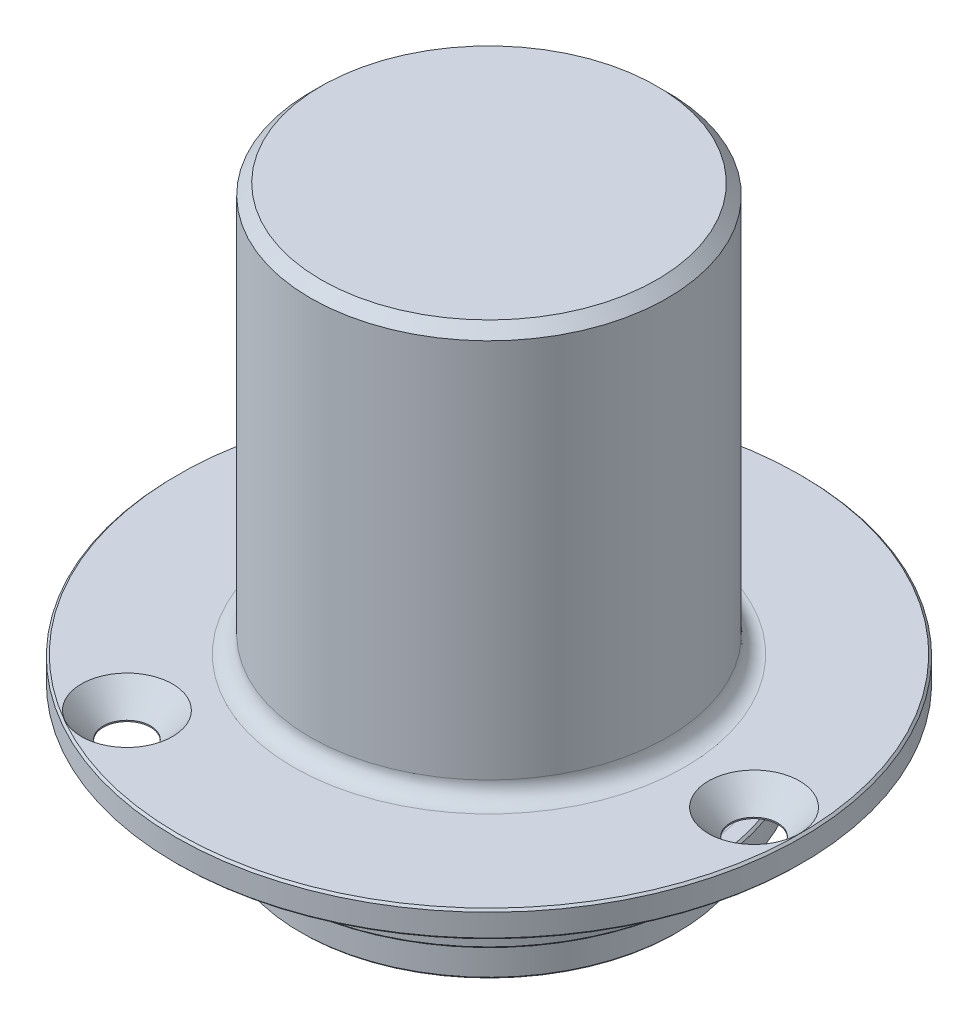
ISO-10303-21;
HEADER;
FILE_DESCRIPTION(('STEP AP214'),'2;1');
FILE_NAME('part.step','',(''),(''),'','','');
FILE_SCHEMA(('AUTOMOTIVE_DESIGN { 1 0 10303 214 1 1 1 1 }'));
ENDSEC;
DATA;
#1=APPLICATION_CONTEXT('core data for automotive mechanical design processes');
#2=APPLICATION_PROTOCOL_DEFINITION('international standard','automotive_design',2000,#1);
#3=PRODUCT_CONTEXT('',#1,'mechanical');
#4=PRODUCT('Part','Part','',(#3));
#5=PRODUCT_RELATED_PRODUCT_CATEGORY('part','',(#4));
#6=PRODUCT_DEFINITION_FORMATION('','',#4);
#7=PRODUCT_DEFINITION_CONTEXT('part definition',#1,'design');
#8=PRODUCT_DEFINITION('design','',#6,#7);
#9=PRODUCT_DEFINITION_SHAPE('','',#8);
#10=(LENGTH_UNIT() NAMED_UNIT(*) SI_UNIT(.MILLI.,.METRE.));
#11=(NAMED_UNIT(*) PLANE_ANGLE_UNIT() SI_UNIT($,.RADIAN.));
#12=(NAMED_UNIT(*) SI_UNIT($,.STERADIAN.) SOLID_ANGLE_UNIT());
#13=UNCERTAINTY_MEASURE_WITH_UNIT(LENGTH_MEASURE(1.E-05),#10,'distance_accuracy_value','');
#14=(GEOMETRIC_REPRESENTATION_CONTEXT(3) GLOBAL_UNCERTAINTY_ASSIGNED_CONTEXT((#13)) GLOBAL_UNIT_ASSIGNED_CONTEXT((#10,
#11,#12)) REPRESENTATION_CONTEXT('',''));
#15=CARTESIAN_POINT('',(0.,0.,0.));
#16=DIRECTION('',(0.,0.,1.));
#17=DIRECTION('',(1.,0.,0.));
#18=AXIS2_PLACEMENT_3D('',#15,#16,#17);
#19=CARTESIAN_POINT('',(-9.04239999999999,5.588,0.));
#20=DIRECTION('',(0.,-1.,0.));
#21=DIRECTION('',(0.,0.,-1.));
#22=AXIS2_PLACEMENT_3D('',#19,#20,#21);
#23=PLANE('',#22);
#24=CARTESIAN_POINT('',(0.,5.588,0.));
#25=DIRECTION('',(0.,-1.,0.));
#26=DIRECTION('',(0.,0.,-1.));
#27=AXIS2_PLACEMENT_3D('',#24,#25,#26);
#28=CIRCLE('',#27,9.54239999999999);
#29=CARTESIAN_POINT('',(0.,5.588,-9.54239999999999));
#30=VERTEX_POINT('',#29);
#31=EDGE_CURVE('E83',#30,#30,#28,.F.);
#32=ORIENTED_EDGE('',*,*,#31,.T.);
#33=EDGE_LOOP('',(#32));
#34=FACE_BOUND('',#33,.T.);
#35=CARTESIAN_POINT('',(0.,5.588,0.));
#36=DIRECTION('',(0.,1.,0.));
#37=DIRECTION('',(0.,0.,1.));
#38=AXIS2_PLACEMENT_3D('',#35,#36,#37);
#39=CIRCLE('',#38,10.3124);
#40=CARTESIAN_POINT('',(0.,5.588,10.3124));
#41=VERTEX_POINT('',#40);
#42=EDGE_CURVE('E80',#41,#41,#39,.T.);
#43=ORIENTED_EDGE('',*,*,#42,.F.);
#44=EDGE_LOOP('',(#43));
#45=FACE_BOUND('',#44,.T.);
#46=ADVANCED_FACE('F35',(#34,#45),#23,.T.);
#47=CARTESIAN_POINT('',(0.,93.1822736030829,0.));
#48=DIRECTION('',(0.,1.,0.));
#49=DIRECTION('',(0.,0.,1.));
#50=AXIS2_PLACEMENT_3D('',#47,#48,#49);
#51=CYLINDRICAL_SURFACE('',#50,9.04239999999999);
#52=CARTESIAN_POINT('',(0.,5.088,0.));
#53=DIRECTION('',(0.,-1.,0.));
#54=DIRECTION('',(0.,0.,-1.));
#55=AXIS2_PLACEMENT_3D('',#52,#53,#54);
#56=CIRCLE('',#55,9.04239999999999);
#57=CARTESIAN_POINT('',(0.,5.088,-9.04239999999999));
#58=VERTEX_POINT('',#57);
#59=EDGE_CURVE('E89',#58,#58,#56,.T.);
#60=ORIENTED_EDGE('',*,*,#59,.T.);
#61=EDGE_LOOP('',(#60));
#62=FACE_BOUND('',#61,.T.);
#63=CARTESIAN_POINT('',(0.,3.929,0.));
#64=DIRECTION('',(0.,1.,0.));
#65=DIRECTION('',(0.,0.,1.));
#66=AXIS2_PLACEMENT_3D('',#63,#64,#65);
#67=CIRCLE('',#66,9.04239999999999);
#68=CARTESIAN_POINT('',(0.,3.929,9.04239999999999));
#69=VERTEX_POINT('',#68);
#70=EDGE_CURVE('E86',#69,#69,#67,.T.);
#71=ORIENTED_EDGE('',*,*,#70,.T.);
#72=EDGE_LOOP('',(#71));
#73=FACE_BOUND('',#72,.T.);
#74=ADVANCED_FACE('F192',(#62,#73),#51,.T.);
#75=CARTESIAN_POINT('',(-10.3124,3.429,0.));
#76=DIRECTION('',(0.,1.,0.));
#77=DIRECTION('',(0.,0.,1.));
#78=AXIS2_PLACEMENT_3D('',#75,#76,#77);
#79=PLANE('',#78);
#80=CARTESIAN_POINT('',(0.,3.429,0.));
#81=DIRECTION('',(0.,1.,0.));
#82=DIRECTION('',(0.,0.,1.));
#83=AXIS2_PLACEMENT_3D('',#80,#81,#82);
#84=CIRCLE('',#83,10.2124);
#85=CARTESIAN_POINT('',(0.,3.429,10.2124));
#86=VERTEX_POINT('',#85);
#87=EDGE_CURVE('E122',#86,#86,#84,.T.);
#88=ORIENTED_EDGE('',*,*,#87,.T.);
#89=EDGE_LOOP('',(#88));
#90=FACE_BOUND('',#89,.T.);
#91=CARTESIAN_POINT('',(0.,3.429,0.));
#92=DIRECTION('',(0.,1.,0.));
#93=DIRECTION('',(0.,0.,1.));
#94=AXIS2_PLACEMENT_3D('',#91,#92,#93);
#95=CIRCLE('',#94,9.54239999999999);
#96=CARTESIAN_POINT('',(0.,3.429,9.54239999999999));
#97=VERTEX_POINT('',#96);
#98=EDGE_CURVE('E92',#97,#97,#95,.F.);
#99=ORIENTED_EDGE('',*,*,#98,.T.);
#100=EDGE_LOOP('',(#99));
#101=FACE_BOUND('',#100,.T.);
#102=ADVANCED_FACE('F188',(#90,#101),#79,.T.);
#103=CARTESIAN_POINT('',(0.,93.1822736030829,0.));
#104=DIRECTION('',(0.,1.,0.));
#105=DIRECTION('',(0.,0.,1.));
#106=AXIS2_PLACEMENT_3D('',#103,#104,#105);
#107=CYLINDRICAL_SURFACE('',#106,10.3124);
#108=CARTESIAN_POINT('',(0.,3.329,0.));
#109=DIRECTION('',(0.,1.,0.));
#110=DIRECTION('',(0.,0.,1.));
#111=AXIS2_PLACEMENT_3D('',#108,#109,#110);
#112=CIRCLE('',#111,10.3124);
#113=CARTESIAN_POINT('',(0.,3.329,10.3124));
#114=VERTEX_POINT('',#113);
#115=EDGE_CURVE('E128',#114,#114,#112,.F.);
#116=ORIENTED_EDGE('',*,*,#115,.T.);
#117=EDGE_LOOP('',(#116));
#118=FACE_BOUND('',#117,.T.);
#119=CARTESIAN_POINT('',(0.,2.259,0.));
#120=DIRECTION('',(0.,-1.,0.));
#121=DIRECTION('',(0.,0.,-1.));
#122=AXIS2_PLACEMENT_3D('',#119,#120,#121);
#123=CIRCLE('',#122,10.3124);
#124=CARTESIAN_POINT('',(0.,2.259,-10.3124));
#125=VERTEX_POINT('',#124);
#126=EDGE_CURVE('E125',#125,#125,#123,.F.);
#127=ORIENTED_EDGE('',*,*,#126,.T.);
#128=EDGE_LOOP('',(#127));
#129=FACE_BOUND('',#128,.T.);
#130=ADVANCED_FACE('F182',(#118,#129),#107,.T.);
#131=CARTESIAN_POINT('',(-10.3124,2.159,0.));
#132=DIRECTION('',(0.,-1.,0.));
#133=DIRECTION('',(0.,0.,-1.));
#134=AXIS2_PLACEMENT_3D('',#131,#132,#133);
#135=PLANE('',#134);
#136=CARTESIAN_POINT('',(0.,2.159,0.));
#137=DIRECTION('',(0.,-1.,0.));
#138=DIRECTION('',(0.,0.,-1.));
#139=AXIS2_PLACEMENT_3D('',#136,#137,#138);
#140=CIRCLE('',#139,10.2124);
#141=CARTESIAN_POINT('',(0.,2.159,-10.2124));
#142=VERTEX_POINT('',#141);
#143=EDGE_CURVE('E131',#142,#142,#140,.T.);
#144=ORIENTED_EDGE('',*,*,#143,.T.);
#145=EDGE_LOOP('',(#144));
#146=FACE_BOUND('',#145,.T.);
#147=CARTESIAN_POINT('',(0.,2.159,0.));
#148=DIRECTION('',(0.,-1.,0.));
#149=DIRECTION('',(0.,0.,-1.));
#150=AXIS2_PLACEMENT_3D('',#147,#148,#149);
#151=CIRCLE('',#150,9.54239999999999);
#152=CARTESIAN_POINT('',(0.,2.159,-9.54239999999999));
#153=VERTEX_POINT('',#152);
#154=EDGE_CURVE('E98',#153,#153,#151,.F.);
#155=ORIENTED_EDGE('',*,*,#154,.T.);
#156=EDGE_LOOP('',(#155));
#157=FACE_BOUND('',#156,.T.);
#158=ADVANCED_FACE('F169',(#146,#157),#135,.T.);
#159=CARTESIAN_POINT('',(0.,93.1822736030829,0.));
#160=DIRECTION('',(0.,1.,0.));
#161=DIRECTION('',(0.,0.,1.));
#162=AXIS2_PLACEMENT_3D('',#159,#160,#161);
#163=CYLINDRICAL_SURFACE('',#162,9.04239999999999);
#164=CARTESIAN_POINT('',(0.,0.100000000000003,0.));
#165=DIRECTION('',(0.,-1.,0.));
#166=DIRECTION('',(0.,0.,-1.));
#167=AXIS2_PLACEMENT_3D('',#164,#165,#166);
#168=CIRCLE('',#167,9.04239999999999);
#169=CARTESIAN_POINT('',(0.,0.100000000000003,-9.04239999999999));
#170=VERTEX_POINT('',#169);
#171=EDGE_CURVE('E134',#170,#170,#168,.F.);
#172=ORIENTED_EDGE('',*,*,#171,.T.);
#173=EDGE_LOOP('',(#172));
#174=FACE_BOUND('',#173,.T.);
#175=CARTESIAN_POINT('',(0.,1.65899999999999,0.));
#176=DIRECTION('',(0.,-1.,0.));
#177=DIRECTION('',(0.,0.,-1.));
#178=AXIS2_PLACEMENT_3D('',#175,#176,#177);
#179=CIRCLE('',#178,9.04239999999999);
#180=CARTESIAN_POINT('',(0.,1.65899999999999,-9.04239999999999));
#181=VERTEX_POINT('',#180);
#182=EDGE_CURVE('E101',#181,#181,#179,.T.);
#183=ORIENTED_EDGE('',*,*,#182,.T.);
#184=EDGE_LOOP('',(#183));
#185=FACE_BOUND('',#184,.T.);
#186=ADVANCED_FACE('F157',(#174,#185),#163,.T.);
#187=CARTESIAN_POINT('',(-7.99999999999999,0.,0.));
#188=DIRECTION('',(0.,-1.,0.));
#189=DIRECTION('',(0.,0.,-1.));
#190=AXIS2_PLACEMENT_3D('',#187,#188,#189);
#191=PLANE('',#190);
#192=CARTESIAN_POINT('',(0.,0.,0.));
#193=DIRECTION('',(0.,-1.,0.));
#194=DIRECTION('',(0.,0.,-1.));
#195=AXIS2_PLACEMENT_3D('',#192,#193,#194);
#196=CIRCLE('',#195,7.24999999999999);
#197=CARTESIAN_POINT('',(0.,0.,-7.24999999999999));
#198=VERTEX_POINT('',#197);
#199=EDGE_CURVE('E140',#198,#198,#196,.F.);
#200=ORIENTED_EDGE('',*,*,#199,.T.);
#201=EDGE_LOOP('',(#200));
#202=FACE_BOUND('',#201,.T.);
#203=CARTESIAN_POINT('',(0.,0.,0.));
#204=DIRECTION('',(0.,-1.,0.));
#205=DIRECTION('',(0.,0.,-1.));
#206=AXIS2_PLACEMENT_3D('',#203,#204,#205);
#207=CIRCLE('',#206,8.94239999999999);
#208=CARTESIAN_POINT('',(0.,0.,-8.94239999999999));
#209=VERTEX_POINT('',#208);
#210=EDGE_CURVE('E137',#209,#209,#207,.T.);
#211=ORIENTED_EDGE('',*,*,#210,.T.);
#212=EDGE_LOOP('',(#211));
#213=FACE_BOUND('',#212,.T.);
#214=ADVANCED_FACE('F154',(#202,#213),#191,.T.);
#215=CARTESIAN_POINT('',(0.,93.1822736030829,0.));
#216=DIRECTION('',(0.,1.,0.));
#217=DIRECTION('',(0.,0.,1.));
#218=AXIS2_PLACEMENT_3D('',#215,#216,#217);
#219=CYLINDRICAL_SURFACE('',#218,6.74999999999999);
#220=CARTESIAN_POINT('',(0.,0.5,0.));
#221=DIRECTION('',(0.,-1.,0.));
#222=DIRECTION('',(0.,0.,-1.));
#223=AXIS2_PLACEMENT_3D('',#220,#221,#222);
#224=CIRCLE('',#223,6.74999999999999);
#225=CARTESIAN_POINT('',(0.,0.5,-6.74999999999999));
#226=VERTEX_POINT('',#225);
#227=EDGE_CURVE('E48',#226,#226,#224,.T.);
#228=ORIENTED_EDGE('',*,*,#227,.T.);
#229=EDGE_LOOP('',(#228));
#230=FACE_BOUND('',#229,.T.);
#231=CARTESIAN_POINT('',(0.,22.86,0.));
#232=DIRECTION('',(0.,1.,0.));
#233=DIRECTION('',(0.,0.,1.));
#234=AXIS2_PLACEMENT_3D('',#231,#232,#233);
#235=CIRCLE('',#234,6.74999999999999);
#236=CARTESIAN_POINT('',(0.,22.86,6.74999999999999));
#237=VERTEX_POINT('',#236);
#238=EDGE_CURVE('E77',#237,#237,#235,.T.);
#239=ORIENTED_EDGE('',*,*,#238,.T.);
#240=EDGE_LOOP('',(#239));
#241=FACE_BOUND('',#240,.T.);
#242=ADVANCED_FACE('F145',(#230,#241),#219,.F.);
#243=CARTESIAN_POINT('',(0.,22.86,0.));
#244=DIRECTION('',(0.,1.,0.));
#245=DIRECTION('',(0.,0.,1.));
#246=AXIS2_PLACEMENT_3D('',#243,#244,#245);
#247=TOROIDAL_SURFACE('',#246,5.47999999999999,1.27);
#248=CARTESIAN_POINT('',(0.,24.13,0.));
#249=DIRECTION('',(0.,1.,0.));
#250=DIRECTION('',(0.,0.,1.));
#251=AXIS2_PLACEMENT_3D('',#248,#249,#250);
#252=CIRCLE('',#251,5.47999999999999);
#253=CARTESIAN_POINT('',(0.,24.13,5.47999999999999));
#254=VERTEX_POINT('',#253);
#255=EDGE_CURVE('E54',#254,#254,#252,.T.);
#256=ORIENTED_EDGE('',*,*,#255,.T.);
#257=EDGE_LOOP('',(#256));
#258=FACE_BOUND('',#257,.T.);
#259=ORIENTED_EDGE('',*,*,#238,.F.);
#260=EDGE_LOOP('',(#259));
#261=FACE_BOUND('',#260,.T.);
#262=ADVANCED_FACE('F442',(#258,#261),#247,.F.);
#263=CARTESIAN_POINT('',(0.,24.13,0.));
#264=DIRECTION('',(0.,-1.,0.));
#265=DIRECTION('',(0.,0.,-1.));
#266=AXIS2_PLACEMENT_3D('',#263,#264,#265);
#267=PLANE('',#266);
#268=ORIENTED_EDGE('',*,*,#255,.F.);
#269=EDGE_LOOP('',(#268));
#270=FACE_BOUND('',#269,.T.);
#271=ADVANCED_FACE('F436',(#270),#267,.T.);
#272=CARTESIAN_POINT('',(-8.54999999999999,26.67,0.));
#273=DIRECTION('',(0.,1.,0.));
#274=DIRECTION('',(0.,0.,1.));
#275=AXIS2_PLACEMENT_3D('',#272,#273,#274);
#276=PLANE('',#275);
#277=CARTESIAN_POINT('',(0.,26.67,0.));
#278=DIRECTION('',(0.,1.,0.));
#279=DIRECTION('',(0.,0.,1.));
#280=AXIS2_PLACEMENT_3D('',#277,#278,#279);
#281=CIRCLE('',#280,8.04199999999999);
#282=CARTESIAN_POINT('',(0.,26.67,8.04199999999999));
#283=VERTEX_POINT('',#282);
#284=EDGE_CURVE('E104',#283,#283,#281,.T.);
#285=ORIENTED_EDGE('',*,*,#284,.T.);
#286=EDGE_LOOP('',(#285));
#287=FACE_BOUND('',#286,.T.);
#288=ADVANCED_FACE('F441',(#287),#276,.T.);
#289=CARTESIAN_POINT('',(0.,93.1822736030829,0.));
#290=DIRECTION('',(0.,1.,0.));
#291=DIRECTION('',(0.,0.,1.));
#292=AXIS2_PLACEMENT_3D('',#289,#290,#291);
#293=CYLINDRICAL_SURFACE('',#292,8.54999999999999);
#294=CARTESIAN_POINT('',(0.,7.9375,0.));
#295=DIRECTION('',(0.,1.,0.));
#296=DIRECTION('',(0.,0.,1.));
#297=AXIS2_PLACEMENT_3D('',#294,#295,#296);
#298=CIRCLE('',#297,8.54999999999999);
#299=CARTESIAN_POINT('',(0.,7.9375,8.54999999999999));
#300=VERTEX_POINT('',#299);
#301=EDGE_CURVE('E43',#300,#300,#298,.T.);
#302=ORIENTED_EDGE('',*,*,#301,.T.);
#303=EDGE_LOOP('',(#302));
#304=FACE_BOUND('',#303,.T.);
#305=CARTESIAN_POINT('',(0.,26.162,0.));
#306=DIRECTION('',(0.,1.,0.));
#307=DIRECTION('',(0.,0.,1.));
#308=AXIS2_PLACEMENT_3D('',#305,#306,#307);
#309=CIRCLE('',#308,8.54999999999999);
#310=CARTESIAN_POINT('',(0.,26.162,8.54999999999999));
#311=VERTEX_POINT('',#310);
#312=EDGE_CURVE('E107',#311,#311,#309,.F.);
#313=ORIENTED_EDGE('',*,*,#312,.T.);
#314=EDGE_LOOP('',(#313));
#315=FACE_BOUND('',#314,.T.);
#316=ADVANCED_FACE('F352',(#304,#315),#293,.T.);
#317=CARTESIAN_POINT('',(-9.52499999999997,7.112,0.));
#318=DIRECTION('',(0.,1.,0.));
#319=DIRECTION('',(0.,0.,1.));
#320=AXIS2_PLACEMENT_3D('',#317,#318,#319);
#321=PLANE('',#320);
#322=CARTESIAN_POINT('',(-6.3499999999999,7.112,10.9985226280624));
#323=DIRECTION('',(0.,1.,0.));
#324=DIRECTION('',(0.,0.,1.));
#325=AXIS2_PLACEMENT_3D('',#322,#323,#324);
#326=CIRCLE('',#325,2.1844);
#327=CARTESIAN_POINT('',(-6.3499999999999,7.112,13.1829226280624));
#328=VERTEX_POINT('',#327);
#329=EDGE_CURVE('E544',#328,#328,#326,.T.);
#330=ORIENTED_EDGE('',*,*,#329,.F.);
#331=EDGE_LOOP('',(#330));
#332=FACE_BOUND('',#331,.T.);
#333=CARTESIAN_POINT('',(-6.35000000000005,7.112,-10.9985226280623));
#334=DIRECTION('',(0.,1.,0.));
#335=DIRECTION('',(0.,0.,1.));
#336=AXIS2_PLACEMENT_3D('',#333,#334,#335);
#337=CIRCLE('',#336,2.1844);
#338=CARTESIAN_POINT('',(-6.35000000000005,7.112,-8.81412262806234));
#339=VERTEX_POINT('',#338);
#340=EDGE_CURVE('E65',#339,#339,#337,.T.);
#341=ORIENTED_EDGE('',*,*,#340,.F.);
#342=EDGE_LOOP('',(#341));
#343=FACE_BOUND('',#342,.T.);
#344=CARTESIAN_POINT('',(12.7,7.112,0.));
#345=DIRECTION('',(0.,1.,0.));
#346=DIRECTION('',(0.,0.,1.));
#347=AXIS2_PLACEMENT_3D('',#344,#345,#346);
#348=CIRCLE('',#347,2.1844);
#349=CARTESIAN_POINT('',(12.7,7.112,2.1844));
#350=VERTEX_POINT('',#349);
#351=EDGE_CURVE('E58',#350,#350,#348,.T.);
#352=ORIENTED_EDGE('',*,*,#351,.F.);
#353=EDGE_LOOP('',(#352));
#354=FACE_BOUND('',#353,.T.);
#355=CARTESIAN_POINT('',(0.,7.112,0.));
#356=DIRECTION('',(0.,1.,0.));
#357=DIRECTION('',(0.,0.,1.));
#358=AXIS2_PLACEMENT_3D('',#355,#356,#357);
#359=CIRCLE('',#358,9.37549999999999);
#360=CARTESIAN_POINT('',(0.,7.112,9.37549999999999));
#361=VERTEX_POINT('',#360);
#362=EDGE_CURVE('E10',#361,#361,#359,.F.);
#363=ORIENTED_EDGE('',*,*,#362,.T.);
#364=EDGE_LOOP('',(#363));
#365=FACE_BOUND('',#364,.T.);
#366=CARTESIAN_POINT('',(0.,7.112,0.));
#367=DIRECTION('',(0.,1.,0.));
#368=DIRECTION('',(0.,0.,1.));
#369=AXIS2_PLACEMENT_3D('',#366,#367,#368);
#370=CIRCLE('',#369,14.9);
#371=CARTESIAN_POINT('',(0.,7.112,14.9));
#372=VERTEX_POINT('',#371);
#373=EDGE_CURVE('E110',#372,#372,#370,.T.);
#374=ORIENTED_EDGE('',*,*,#373,.T.);
#375=EDGE_LOOP('',(#374));
#376=FACE_BOUND('',#375,.T.);
#377=ADVANCED_FACE('F348',(#332,#343,#354,#365,#376),#321,.T.);
#378=CARTESIAN_POINT('',(0.,93.1822736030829,0.));
#379=DIRECTION('',(0.,1.,0.));
#380=DIRECTION('',(0.,0.,1.));
#381=AXIS2_PLACEMENT_3D('',#378,#379,#380);
#382=CYLINDRICAL_SURFACE('',#381,15.);
#383=CARTESIAN_POINT('',(0.,7.01199999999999,0.));
#384=DIRECTION('',(0.,1.,0.));
#385=DIRECTION('',(0.,0.,1.));
#386=AXIS2_PLACEMENT_3D('',#383,#384,#385);
#387=CIRCLE('',#386,15.);
#388=CARTESIAN_POINT('',(0.,7.01199999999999,15.));
#389=VERTEX_POINT('',#388);
#390=EDGE_CURVE('E116',#389,#389,#387,.F.);
#391=ORIENTED_EDGE('',*,*,#390,.T.);
#392=EDGE_LOOP('',(#391));
#393=FACE_BOUND('',#392,.T.);
#394=CARTESIAN_POINT('',(0.,5.942,0.));
#395=DIRECTION('',(0.,-1.,0.));
#396=DIRECTION('',(0.,0.,-1.));
#397=AXIS2_PLACEMENT_3D('',#394,#395,#396);
#398=CIRCLE('',#397,15.);
#399=CARTESIAN_POINT('',(0.,5.942,-15.));
#400=VERTEX_POINT('',#399);
#401=EDGE_CURVE('E113',#400,#400,#398,.F.);
#402=ORIENTED_EDGE('',*,*,#401,.T.);
#403=EDGE_LOOP('',(#402));
#404=FACE_BOUND('',#403,.T.);
#405=ADVANCED_FACE('F339',(#393,#404),#382,.T.);
#406=CARTESIAN_POINT('',(-15.,5.842,0.));
#407=DIRECTION('',(0.,-1.,0.));
#408=DIRECTION('',(0.,0.,-1.));
#409=AXIS2_PLACEMENT_3D('',#406,#407,#408);
#410=PLANE('',#409);
#411=CARTESIAN_POINT('',(-6.3499999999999,5.842,10.9985226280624));
#412=DIRECTION('',(0.,-1.,0.));
#413=DIRECTION('',(0.,0.,-1.));
#414=AXIS2_PLACEMENT_3D('',#411,#412,#413);
#415=CIRCLE('',#414,1.1303);
#416=CARTESIAN_POINT('',(-6.3499999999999,5.842,9.86822262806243));
#417=VERTEX_POINT('',#416);
#418=EDGE_CURVE('E39',#417,#417,#415,.T.);
#419=ORIENTED_EDGE('',*,*,#418,.F.);
#420=EDGE_LOOP('',(#419));
#421=FACE_BOUND('',#420,.T.);
#422=CARTESIAN_POINT('',(-6.35000000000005,5.842,-10.9985226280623));
#423=DIRECTION('',(0.,-1.,0.));
#424=DIRECTION('',(0.,0.,-1.));
#425=AXIS2_PLACEMENT_3D('',#422,#423,#424);
#426=CIRCLE('',#425,1.1303);
#427=CARTESIAN_POINT('',(-6.35000000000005,5.842,-12.1288226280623));
#428=VERTEX_POINT('',#427);
#429=EDGE_CURVE('E56',#428,#428,#426,.T.);
#430=ORIENTED_EDGE('',*,*,#429,.F.);
#431=EDGE_LOOP('',(#430));
#432=FACE_BOUND('',#431,.T.);
#433=CARTESIAN_POINT('',(12.7,5.842,0.));
#434=DIRECTION('',(0.,-1.,0.));
#435=DIRECTION('',(0.,0.,-1.));
#436=AXIS2_PLACEMENT_3D('',#433,#434,#435);
#437=CIRCLE('',#436,1.1303);
#438=CARTESIAN_POINT('',(12.7,5.842,-1.1303));
#439=VERTEX_POINT('',#438);
#440=EDGE_CURVE('E52',#439,#439,#437,.T.);
#441=ORIENTED_EDGE('',*,*,#440,.F.);
#442=EDGE_LOOP('',(#441));
#443=FACE_BOUND('',#442,.T.);
#444=CARTESIAN_POINT('',(0.,5.842,0.));
#445=DIRECTION('',(0.,-1.,0.));
#446=DIRECTION('',(0.,0.,-1.));
#447=AXIS2_PLACEMENT_3D('',#444,#445,#446);
#448=CIRCLE('',#447,14.9);
#449=CARTESIAN_POINT('',(0.,5.842,-14.9));
#450=VERTEX_POINT('',#449);
#451=EDGE_CURVE('E119',#450,#450,#448,.T.);
#452=ORIENTED_EDGE('',*,*,#451,.T.);
#453=EDGE_LOOP('',(#452));
#454=FACE_BOUND('',#453,.T.);
#455=CARTESIAN_POINT('',(0.,5.842,0.));
#456=DIRECTION('',(0.,-1.,0.));
#457=DIRECTION('',(0.,0.,-1.));
#458=AXIS2_PLACEMENT_3D('',#455,#456,#457);
#459=CIRCLE('',#458,10.7476975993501);
#460=CARTESIAN_POINT('',(0.,5.842,-10.7476975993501));
#461=VERTEX_POINT('',#460);
#462=EDGE_CURVE('E95',#461,#461,#459,.F.);
#463=ORIENTED_EDGE('',*,*,#462,.T.);
#464=EDGE_LOOP('',(#463));
#465=FACE_BOUND('',#464,.T.);
#466=ADVANCED_FACE('F207',(#421,#432,#443,#454,#465),#410,.T.);
#467=CARTESIAN_POINT('',(0.,5.088,0.));
#468=DIRECTION('',(0.,-1.,0.));
#469=DIRECTION('',(0.,0.,-1.));
#470=AXIS2_PLACEMENT_3D('',#467,#468,#469);
#471=TOROIDAL_SURFACE('',#470,9.54239999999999,0.5);
#472=ORIENTED_EDGE('',*,*,#59,.F.);
#473=EDGE_LOOP('',(#472));
#474=FACE_BOUND('',#473,.T.);
#475=ORIENTED_EDGE('',*,*,#31,.F.);
#476=EDGE_LOOP('',(#475));
#477=FACE_BOUND('',#476,.T.);
#478=ADVANCED_FACE('F203',(#474,#477),#471,.F.);
#479=CARTESIAN_POINT('',(0.,3.929,0.));
#480=DIRECTION('',(0.,1.,0.));
#481=DIRECTION('',(0.,0.,1.));
#482=AXIS2_PLACEMENT_3D('',#479,#480,#481);
#483=TOROIDAL_SURFACE('',#482,9.54239999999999,0.5);
#484=ORIENTED_EDGE('',*,*,#98,.F.);
#485=EDGE_LOOP('',(#484));
#486=FACE_BOUND('',#485,.T.);
#487=ORIENTED_EDGE('',*,*,#70,.F.);
#488=EDGE_LOOP('',(#487));
#489=FACE_BOUND('',#488,.T.);
#490=ADVANCED_FACE('F206',(#486,#489),#483,.F.);
#491=CARTESIAN_POINT('',(0.,5.342,0.));
#492=DIRECTION('',(0.,-1.,0.));
#493=DIRECTION('',(0.,0.,-1.));
#494=AXIS2_PLACEMENT_3D('',#491,#492,#493);
#495=TOROIDAL_SURFACE('',#494,10.7476975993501,0.5);
#496=ORIENTED_EDGE('',*,*,#42,.T.);
#497=EDGE_LOOP('',(#496));
#498=FACE_BOUND('',#497,.T.);
#499=ORIENTED_EDGE('',*,*,#462,.F.);
#500=EDGE_LOOP('',(#499));
#501=FACE_BOUND('',#500,.T.);
#502=ADVANCED_FACE('F177',(#498,#501),#495,.F.);
#503=CARTESIAN_POINT('',(0.,1.65899999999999,0.));
#504=DIRECTION('',(0.,-1.,0.));
#505=DIRECTION('',(0.,0.,-1.));
#506=AXIS2_PLACEMENT_3D('',#503,#504,#505);
#507=TOROIDAL_SURFACE('',#506,9.54239999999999,0.5);
#508=ORIENTED_EDGE('',*,*,#182,.F.);
#509=EDGE_LOOP('',(#508));
#510=FACE_BOUND('',#509,.T.);
#511=ORIENTED_EDGE('',*,*,#154,.F.);
#512=EDGE_LOOP('',(#511));
#513=FACE_BOUND('',#512,.T.);
#514=ADVANCED_FACE('F173',(#510,#513),#507,.F.);
#515=CARTESIAN_POINT('',(0.,26.67,0.));
#516=DIRECTION('',(0.,-1.,0.));
#517=DIRECTION('',(0.,0.,-1.));
#518=AXIS2_PLACEMENT_3D('',#515,#516,#517);
#519=CONICAL_SURFACE('',#518,8.04199999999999,0.78539816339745);
#520=ORIENTED_EDGE('',*,*,#312,.F.);
#521=EDGE_LOOP('',(#520));
#522=FACE_BOUND('',#521,.T.);
#523=ORIENTED_EDGE('',*,*,#284,.F.);
#524=EDGE_LOOP('',(#523));
#525=FACE_BOUND('',#524,.T.);
#526=ADVANCED_FACE('F176',(#522,#525),#519,.T.);
#527=CARTESIAN_POINT('',(0.,7.11200000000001,0.));
#528=DIRECTION('',(0.,-1.,0.));
#529=DIRECTION('',(0.,0.,-1.));
#530=AXIS2_PLACEMENT_3D('',#527,#528,#529);
#531=CONICAL_SURFACE('',#530,14.9,0.785398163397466);
#532=ORIENTED_EDGE('',*,*,#390,.F.);
#533=EDGE_LOOP('',(#532));
#534=FACE_BOUND('',#533,.T.);
#535=ORIENTED_EDGE('',*,*,#373,.F.);
#536=EDGE_LOOP('',(#535));
#537=FACE_BOUND('',#536,.T.);
#538=ADVANCED_FACE('F217',(#534,#537),#531,.T.);
#539=CARTESIAN_POINT('',(0.,5.942,0.));
#540=DIRECTION('',(0.,1.,0.));
#541=DIRECTION('',(0.,0.,1.));
#542=AXIS2_PLACEMENT_3D('',#539,#540,#541);
#543=CONICAL_SURFACE('',#542,15.,0.785398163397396);
#544=ORIENTED_EDGE('',*,*,#451,.F.);
#545=EDGE_LOOP('',(#544));
#546=FACE_BOUND('',#545,.T.);
#547=ORIENTED_EDGE('',*,*,#401,.F.);
#548=EDGE_LOOP('',(#547));
#549=FACE_BOUND('',#548,.T.);
#550=ADVANCED_FACE('F221',(#546,#549),#543,.T.);
#551=CARTESIAN_POINT('',(0.,3.429,0.));
#552=DIRECTION('',(0.,-1.,0.));
#553=DIRECTION('',(0.,0.,-1.));
#554=AXIS2_PLACEMENT_3D('',#551,#552,#553);
#555=CONICAL_SURFACE('',#554,10.2124,0.78539816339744);
#556=ORIENTED_EDGE('',*,*,#115,.F.);
#557=EDGE_LOOP('',(#556));
#558=FACE_BOUND('',#557,.T.);
#559=ORIENTED_EDGE('',*,*,#87,.F.);
#560=EDGE_LOOP('',(#559));
#561=FACE_BOUND('',#560,.T.);
#562=ADVANCED_FACE('F225',(#558,#561),#555,.T.);
#563=CARTESIAN_POINT('',(0.,2.259,0.));
#564=DIRECTION('',(0.,1.,0.));
#565=DIRECTION('',(0.,0.,1.));
#566=AXIS2_PLACEMENT_3D('',#563,#564,#565);
#567=CONICAL_SURFACE('',#566,10.3124,0.78539816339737);
#568=ORIENTED_EDGE('',*,*,#143,.F.);
#569=EDGE_LOOP('',(#568));
#570=FACE_BOUND('',#569,.T.);
#571=ORIENTED_EDGE('',*,*,#126,.F.);
#572=EDGE_LOOP('',(#571));
#573=FACE_BOUND('',#572,.T.);
#574=ADVANCED_FACE('F163',(#570,#573),#567,.T.);
#575=CARTESIAN_POINT('',(0.,0.100000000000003,0.));
#576=DIRECTION('',(0.,1.,0.));
#577=DIRECTION('',(0.,0.,1.));
#578=AXIS2_PLACEMENT_3D('',#575,#576,#577);
#579=CONICAL_SURFACE('',#578,9.04239999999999,0.785398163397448);
#580=ORIENTED_EDGE('',*,*,#210,.F.);
#581=EDGE_LOOP('',(#580));
#582=FACE_BOUND('',#581,.T.);
#583=ORIENTED_EDGE('',*,*,#171,.F.);
#584=EDGE_LOOP('',(#583));
#585=FACE_BOUND('',#584,.T.);
#586=ADVANCED_FACE('F151',(#582,#585),#579,.T.);
#587=CARTESIAN_POINT('',(0.,0.,0.));
#588=DIRECTION('',(0.,-1.,0.));
#589=DIRECTION('',(0.,0.,-1.));
#590=AXIS2_PLACEMENT_3D('',#587,#588,#589);
#591=CONICAL_SURFACE('',#590,7.24999999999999,0.785398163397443);
#592=ORIENTED_EDGE('',*,*,#227,.F.);
#593=EDGE_LOOP('',(#592));
#594=FACE_BOUND('',#593,.T.);
#595=ORIENTED_EDGE('',*,*,#199,.F.);
#596=EDGE_LOOP('',(#595));
#597=FACE_BOUND('',#596,.T.);
#598=ADVANCED_FACE('F148',(#594,#597),#591,.F.);
#599=CARTESIAN_POINT('',(0.,7.9375,0.));
#600=DIRECTION('',(0.,1.,0.));
#601=DIRECTION('',(0.,0.,1.));
#602=AXIS2_PLACEMENT_3D('',#599,#600,#601);
#603=TOROIDAL_SURFACE('',#602,9.37549999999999,0.8255);
#604=ORIENTED_EDGE('',*,*,#362,.F.);
#605=EDGE_LOOP('',(#604));
#606=FACE_BOUND('',#605,.T.);
#607=ORIENTED_EDGE('',*,*,#301,.F.);
#608=EDGE_LOOP('',(#607));
#609=FACE_BOUND('',#608,.T.);
#610=ADVANCED_FACE('F37',(#606,#609),#603,.F.);
#611=CARTESIAN_POINT('',(12.7,7.112,0.));
#612=DIRECTION('',(0.,1.,0.));
#613=DIRECTION('',(0.,0.,1.));
#614=AXIS2_PLACEMENT_3D('',#611,#612,#613);
#615=CYLINDRICAL_SURFACE('',#614,1.1303);
#616=ORIENTED_EDGE('',*,*,#440,.T.);
#617=EDGE_LOOP('',(#616));
#618=FACE_BOUND('',#617,.T.);
#619=CARTESIAN_POINT('',(12.7,5.89939666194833,0.));
#620=DIRECTION('',(0.,1.,0.));
#621=DIRECTION('',(0.,0.,1.));
#622=AXIS2_PLACEMENT_3D('',#619,#620,#621);
#623=CIRCLE('',#622,1.1303);
#624=CARTESIAN_POINT('',(12.7,5.89939666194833,1.1303));
#625=VERTEX_POINT('',#624);
#626=EDGE_CURVE('E55',#625,#625,#623,.T.);
#627=ORIENTED_EDGE('',*,*,#626,.T.);
#628=EDGE_LOOP('',(#627));
#629=FACE_BOUND('',#628,.T.);
#630=ADVANCED_FACE('F257',(#618,#629),#615,.F.);
#631=CARTESIAN_POINT('',(12.7,7.112,0.));
#632=DIRECTION('',(0.,1.,0.));
#633=DIRECTION('',(0.,0.,1.));
#634=AXIS2_PLACEMENT_3D('',#631,#632,#633);
#635=CONICAL_SURFACE('',#634,2.1844,0.715584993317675);
#636=ORIENTED_EDGE('',*,*,#626,.F.);
#637=EDGE_LOOP('',(#636));
#638=FACE_BOUND('',#637,.T.);
#639=ORIENTED_EDGE('',*,*,#351,.T.);
#640=EDGE_LOOP('',(#639));
#641=FACE_BOUND('',#640,.T.);
#642=ADVANCED_FACE('F264',(#638,#641),#635,.F.);
#643=CARTESIAN_POINT('',(-6.35000000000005,7.112,-10.9985226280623));
#644=DIRECTION('',(0.,1.,0.));
#645=DIRECTION('',(0.,0.,1.));
#646=AXIS2_PLACEMENT_3D('',#643,#644,#645);
#647=CYLINDRICAL_SURFACE('',#646,1.1303);
#648=ORIENTED_EDGE('',*,*,#429,.T.);
#649=EDGE_LOOP('',(#648));
#650=FACE_BOUND('',#649,.T.);
#651=CARTESIAN_POINT('',(-6.35000000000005,5.89939666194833,-10.9985226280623));
#652=DIRECTION('',(0.,1.,0.));
#653=DIRECTION('',(0.,0.,1.));
#654=AXIS2_PLACEMENT_3D('',#651,#652,#653);
#655=CIRCLE('',#654,1.1303);
#656=CARTESIAN_POINT('',(-6.35000000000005,5.89939666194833,-9.86822262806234));
#657=VERTEX_POINT('',#656);
#658=EDGE_CURVE('E59',#657,#657,#655,.T.);
#659=ORIENTED_EDGE('',*,*,#658,.T.);
#660=EDGE_LOOP('',(#659));
#661=FACE_BOUND('',#660,.T.);
#662=ADVANCED_FACE('F272',(#650,#661),#647,.F.);
#663=CARTESIAN_POINT('',(-6.35000000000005,7.112,-10.9985226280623));
#664=DIRECTION('',(0.,1.,0.));
#665=DIRECTION('',(0.,0.,1.));
#666=AXIS2_PLACEMENT_3D('',#663,#664,#665);
#667=CONICAL_SURFACE('',#666,2.1844,0.715584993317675);
#668=ORIENTED_EDGE('',*,*,#658,.F.);
#669=EDGE_LOOP('',(#668));
#670=FACE_BOUND('',#669,.T.);
#671=ORIENTED_EDGE('',*,*,#340,.T.);
#672=EDGE_LOOP('',(#671));
#673=FACE_BOUND('',#672,.T.);
#674=ADVANCED_FACE('F281',(#670,#673),#667,.F.);
#675=CARTESIAN_POINT('',(-6.3499999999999,7.112,10.9985226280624));
#676=DIRECTION('',(0.,1.,0.));
#677=DIRECTION('',(0.,0.,1.));
#678=AXIS2_PLACEMENT_3D('',#675,#676,#677);
#679=CYLINDRICAL_SURFACE('',#678,1.1303);
#680=ORIENTED_EDGE('',*,*,#418,.T.);
#681=EDGE_LOOP('',(#680));
#682=FACE_BOUND('',#681,.T.);
#683=CARTESIAN_POINT('',(-6.3499999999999,5.89939666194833,10.9985226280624));
#684=DIRECTION('',(0.,1.,0.));
#685=DIRECTION('',(0.,0.,1.));
#686=AXIS2_PLACEMENT_3D('',#683,#684,#685);
#687=CIRCLE('',#686,1.1303);
#688=CARTESIAN_POINT('',(-6.3499999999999,5.89939666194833,12.1288226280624));
#689=VERTEX_POINT('',#688);
#690=EDGE_CURVE('E551',#689,#689,#687,.T.);
#691=ORIENTED_EDGE('',*,*,#690,.T.);
#692=EDGE_LOOP('',(#691));
#693=FACE_BOUND('',#692,.T.);
#694=ADVANCED_FACE('F289',(#682,#693),#679,.F.);
#695=CARTESIAN_POINT('',(-6.3499999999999,7.112,10.9985226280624));
#696=DIRECTION('',(0.,1.,0.));
#697=DIRECTION('',(0.,0.,1.));
#698=AXIS2_PLACEMENT_3D('',#695,#696,#697);
#699=CONICAL_SURFACE('',#698,2.1844,0.715584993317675);
#700=ORIENTED_EDGE('',*,*,#690,.F.);
#701=EDGE_LOOP('',(#700));
#702=FACE_BOUND('',#701,.T.);
#703=ORIENTED_EDGE('',*,*,#329,.T.);
#704=EDGE_LOOP('',(#703));
#705=FACE_BOUND('',#704,.T.);
#706=ADVANCED_FACE('F297',(#702,#705),#699,.F.);
#707=CLOSED_SHELL('',(#46,#74,#102,#130,#158,#186,#214,#242,#262,#271,#288,#316,#377,#405,#466,
#478,#490,#502,#514,#526,#538,#550,#562,#574,#586,#598,#610,#630,#642,#662,#674,#694,#706));
#708=MANIFOLD_SOLID_BREP('B2',#707);
#709=ADVANCED_BREP_SHAPE_REPRESENTATION('',(#18,#708),#14);
#710=SHAPE_DEFINITION_REPRESENTATION(#9,#709);
ENDSEC;
END-ISO-10303-21;
